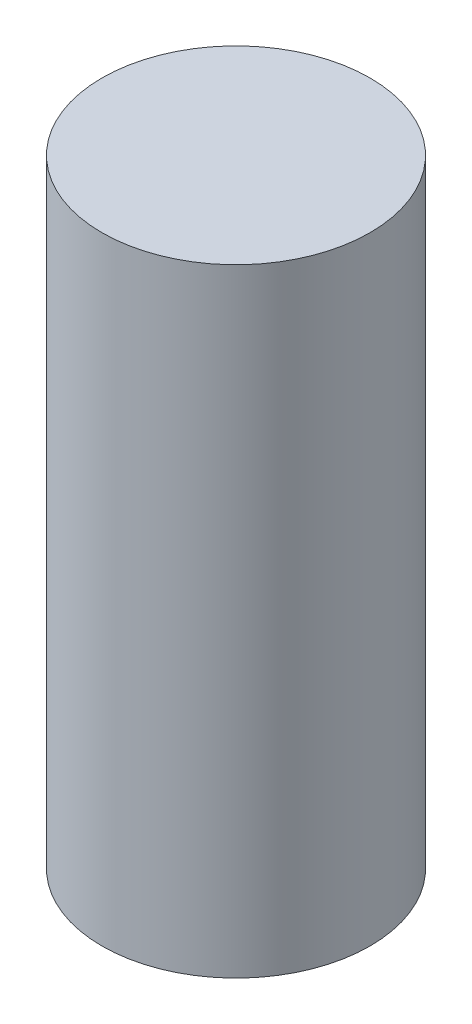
from build123d import *

# Parameters (mm, degrees)
SKETCH1_R           = 9.0043
BOSS_EXTRUDE1_DEPTH = 41.5036


with BuildPart() as part:
    # Sketch1 → Boss-Extrude1 (new body)
    with BuildSketch(Plane(origin=(0, 0, 0), x_dir=(1, 0, 0), z_dir=(0, 1, 0))):
        with Locations(Location((0, 0, 0), (0, 0, 90))):
            Circle(SKETCH1_R)
    extrude(amount=BOSS_EXTRUDE1_DEPTH)


solid = part.part
